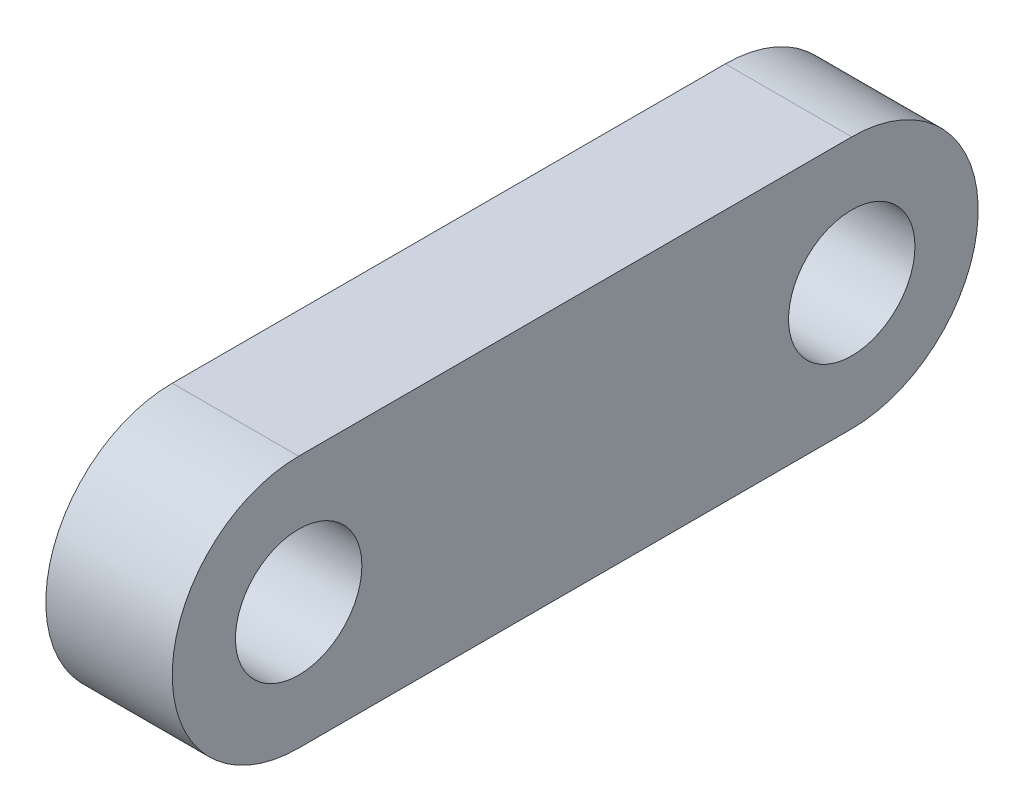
from build123d import *

# Parameters (mm, degrees)
SKETCH1_R           = 20
BOSS_EXTRUDE1_DEPTH = 20


with BuildPart() as part:
    # Sketch1 → Boss-Extrude1 (new, symmetric)
    with BuildSketch(Plane(origin=(0, 0, 0), x_dir=(0, 0, -1), z_dir=(1, 0, 0))):
        with BuildLine():
            Line((-87.5, 40), (87.5, 40))
            ThreePointArc((87.5, 40), (127.5, 0), (87.5, -40))
            Line((87.5, -40), (-87.5, -40))
            ThreePointArc((-87.5, -40), (-127.5, 0), (-87.5, 40))
        make_face()
        with Locations((-87.5, 0)):
            Circle(SKETCH1_R, mode=Mode.SUBTRACT)
        with Locations((87.5, 0)):
            Circle(SKETCH1_R, mode=Mode.SUBTRACT)
    extrude(amount=BOSS_EXTRUDE1_DEPTH, both=True)


solid = part.part
